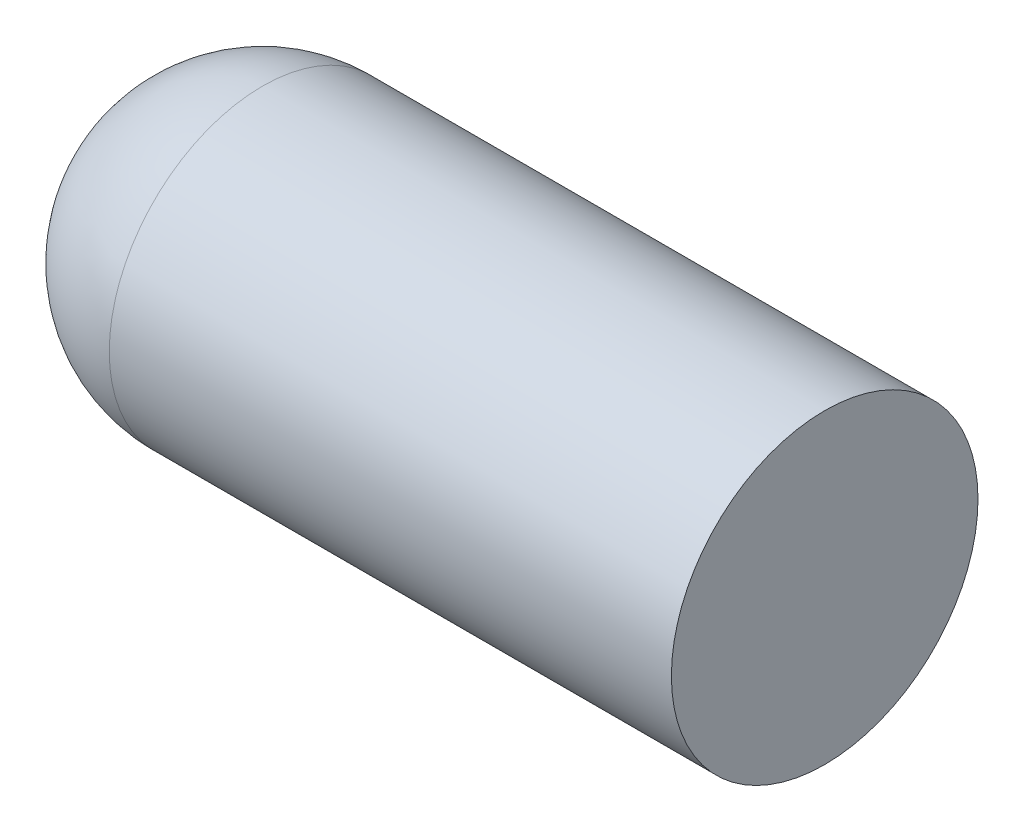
ISO-10303-21;
HEADER;
FILE_DESCRIPTION(('STEP AP214'),'2;1');
FILE_NAME('part.step','',(''),(''),'','','');
FILE_SCHEMA(('AUTOMOTIVE_DESIGN { 1 0 10303 214 1 1 1 1 }'));
ENDSEC;
DATA;
#1=APPLICATION_CONTEXT('core data for automotive mechanical design processes');
#2=APPLICATION_PROTOCOL_DEFINITION('international standard','automotive_design',2000,#1);
#3=PRODUCT_CONTEXT('',#1,'mechanical');
#4=PRODUCT('Part','Part','',(#3));
#5=PRODUCT_RELATED_PRODUCT_CATEGORY('part','',(#4));
#6=PRODUCT_DEFINITION_FORMATION('','',#4);
#7=PRODUCT_DEFINITION_CONTEXT('part definition',#1,'design');
#8=PRODUCT_DEFINITION('design','',#6,#7);
#9=PRODUCT_DEFINITION_SHAPE('','',#8);
#10=(LENGTH_UNIT() NAMED_UNIT(*) SI_UNIT(.MILLI.,.METRE.));
#11=(NAMED_UNIT(*) PLANE_ANGLE_UNIT() SI_UNIT($,.RADIAN.));
#12=(NAMED_UNIT(*) SI_UNIT($,.STERADIAN.) SOLID_ANGLE_UNIT());
#13=UNCERTAINTY_MEASURE_WITH_UNIT(LENGTH_MEASURE(1.E-05),#10,'distance_accuracy_value','');
#14=(GEOMETRIC_REPRESENTATION_CONTEXT(3) GLOBAL_UNCERTAINTY_ASSIGNED_CONTEXT((#13)) GLOBAL_UNIT_ASSIGNED_CONTEXT((#10,
#11,#12)) REPRESENTATION_CONTEXT('',''));
#15=CARTESIAN_POINT('',(0.,0.,0.));
#16=DIRECTION('',(0.,0.,1.));
#17=DIRECTION('',(1.,0.,0.));
#18=AXIS2_PLACEMENT_3D('',#15,#16,#17);
#19=CARTESIAN_POINT('',(-6.965,-159.2,0.));
#20=DIRECTION('',(1.,0.,0.));
#21=DIRECTION('',(0.,1.,0.));
#22=AXIS2_PLACEMENT_3D('',#19,#20,#21);
#23=CYLINDRICAL_SURFACE('',#22,1.4925);
#24=CARTESIAN_POINT('',(-5.4725,-159.2,0.));
#25=DIRECTION('',(1.,0.,0.));
#26=DIRECTION('',(0.,0.,-1.));
#27=AXIS2_PLACEMENT_3D('',#24,#25,#26);
#28=CIRCLE('',#27,1.4925);
#29=CARTESIAN_POINT('',(-5.4725,-159.2,-1.4925));
#30=VERTEX_POINT('',#29);
#31=EDGE_CURVE('E10',#30,#30,#28,.T.);
#32=ORIENTED_EDGE('',*,*,#31,.T.);
#33=EDGE_LOOP('',(#32));
#34=FACE_BOUND('',#33,.T.);
#35=CARTESIAN_POINT('',(0.,-159.2,0.));
#36=DIRECTION('',(-1.,0.,0.));
#37=DIRECTION('',(0.,-1.,0.));
#38=AXIS2_PLACEMENT_3D('',#35,#36,#37);
#39=CIRCLE('',#38,1.4925);
#40=CARTESIAN_POINT('',(0.,-160.6925,0.));
#41=VERTEX_POINT('',#40);
#42=EDGE_CURVE('E21',#41,#41,#39,.T.);
#43=ORIENTED_EDGE('',*,*,#42,.T.);
#44=EDGE_LOOP('',(#43));
#45=FACE_BOUND('',#44,.T.);
#46=ADVANCED_FACE('F14',(#34,#45),#23,.T.);
#47=CARTESIAN_POINT('',(0.,-159.2,0.));
#48=DIRECTION('',(-1.,0.,0.));
#49=DIRECTION('',(0.,-1.,0.));
#50=AXIS2_PLACEMENT_3D('',#47,#48,#49);
#51=PLANE('',#50);
#52=ORIENTED_EDGE('',*,*,#42,.F.);
#53=EDGE_LOOP('',(#52));
#54=FACE_BOUND('',#53,.T.);
#55=ADVANCED_FACE('F47',(#54),#51,.F.);
#56=CARTESIAN_POINT('',(-5.4725,-159.2,0.));
#57=DIRECTION('',(0.,0.,1.));
#58=DIRECTION('',(1.,0.,0.));
#59=AXIS2_PLACEMENT_3D('',#56,#57,#58);
#60=SPHERICAL_SURFACE('',#59,1.4925);
#61=CARTESIAN_POINT('',(-5.4725,-159.2,0.));
#62=DIRECTION('',(1.,0.,0.));
#63=DIRECTION('',(0.,0.,-1.));
#64=AXIS2_PLACEMENT_3D('',#61,#62,#63);
#65=SPHERICAL_SURFACE('',#64,1.4925);
#66=ORIENTED_EDGE('',*,*,#31,.F.);
#67=EDGE_LOOP('',(#66));
#68=FACE_BOUND('',#67,.T.);
#69=ADVANCED_FACE('F49',(#68),#65,.T.);
#70=CLOSED_SHELL('',(#46,#55,#69));
#71=MANIFOLD_SOLID_BREP('B1',#70);
#72=ADVANCED_BREP_SHAPE_REPRESENTATION('',(#18,#71),#14);
#73=SHAPE_DEFINITION_REPRESENTATION(#9,#72);
ENDSEC;
END-ISO-10303-21;
